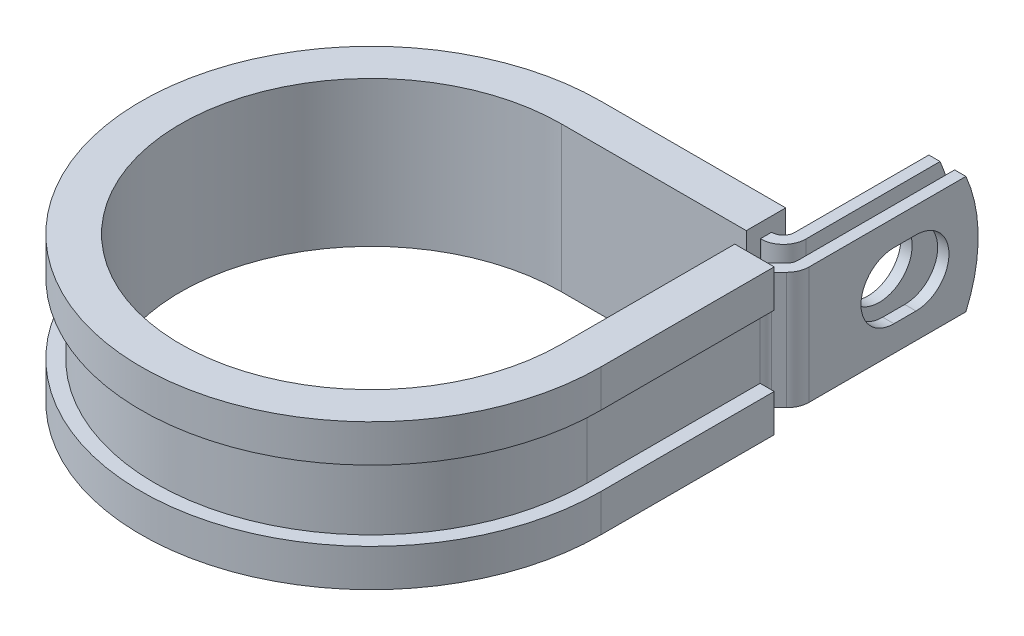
ISO-10303-21;
HEADER;
FILE_DESCRIPTION(('STEP AP214'),'2;1');
FILE_NAME('part.step','',(''),(''),'','','');
FILE_SCHEMA(('AUTOMOTIVE_DESIGN { 1 0 10303 214 1 1 1 1 }'));
ENDSEC;
DATA;
#1=APPLICATION_CONTEXT('core data for automotive mechanical design processes');
#2=APPLICATION_PROTOCOL_DEFINITION('international standard','automotive_design',2000,#1);
#3=PRODUCT_CONTEXT('',#1,'mechanical');
#4=PRODUCT('Part','Part','',(#3));
#5=PRODUCT_RELATED_PRODUCT_CATEGORY('part','',(#4));
#6=PRODUCT_DEFINITION_FORMATION('','',#4);
#7=PRODUCT_DEFINITION_CONTEXT('part definition',#1,'design');
#8=PRODUCT_DEFINITION('design','',#6,#7);
#9=PRODUCT_DEFINITION_SHAPE('','',#8);
#10=(LENGTH_UNIT() NAMED_UNIT(*) SI_UNIT(.MILLI.,.METRE.));
#11=(NAMED_UNIT(*) PLANE_ANGLE_UNIT() SI_UNIT($,.RADIAN.));
#12=(NAMED_UNIT(*) SI_UNIT($,.STERADIAN.) SOLID_ANGLE_UNIT());
#13=UNCERTAINTY_MEASURE_WITH_UNIT(LENGTH_MEASURE(1.E-05),#10,'distance_accuracy_value','');
#14=(GEOMETRIC_REPRESENTATION_CONTEXT(3) GLOBAL_UNCERTAINTY_ASSIGNED_CONTEXT((#13)) GLOBAL_UNIT_ASSIGNED_CONTEXT((#10,
#11,#12)) REPRESENTATION_CONTEXT('',''));
#15=CARTESIAN_POINT('',(0.,0.,0.));
#16=DIRECTION('',(0.,0.,1.));
#17=DIRECTION('',(1.,0.,0.));
#18=AXIS2_PLACEMENT_3D('',#15,#16,#17);
#19=CARTESIAN_POINT('',(22.8397698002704,-6.35,-22.1615));
#20=DIRECTION('',(0.,1.,0.));
#21=DIRECTION('',(1.,0.,0.));
#22=AXIS2_PLACEMENT_3D('',#19,#20,#21);
#23=PLANE('',#22);
#24=DIRECTION('',(0.,0.,-1.));
#25=VECTOR('',#24,1.);
#26=CARTESIAN_POINT('',(19.9949698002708,-6.35,-22.1615));
#27=LINE('',#26,#25);
#28=CARTESIAN_POINT('',(19.9949698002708,-6.35,-22.1615));
#29=VERTEX_POINT('',#28);
#30=CARTESIAN_POINT('',(19.9949698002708,-6.35,-23.3807));
#31=VERTEX_POINT('',#30);
#32=EDGE_CURVE('E523',#29,#31,#27,.T.);
#33=ORIENTED_EDGE('',*,*,#32,.T.);
#34=DIRECTION('',(1.,0.,0.));
#35=VECTOR('',#34,1.);
#36=CARTESIAN_POINT('',(0.,-6.35,-23.3807));
#37=LINE('',#36,#35);
#38=CARTESIAN_POINT('',(20.0457698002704,-6.35,-23.3807));
#39=VERTEX_POINT('',#38);
#40=EDGE_CURVE('E410',#39,#31,#37,.F.);
#41=ORIENTED_EDGE('',*,*,#40,.F.);
#42=CARTESIAN_POINT('',(20.0457698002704,-6.35,-24.5999));
#43=DIRECTION('',(0.,1.,0.));
#44=DIRECTION('',(1.,0.,0.));
#45=AXIS2_PLACEMENT_3D('',#42,#43,#44);
#46=CIRCLE('',#45,1.2192);
#47=CARTESIAN_POINT('',(21.2649698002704,-6.35,-24.5999));
#48=VERTEX_POINT('',#47);
#49=EDGE_CURVE('E408',#48,#39,#46,.F.);
#50=ORIENTED_EDGE('',*,*,#49,.F.);
#51=DIRECTION('',(0.,0.,1.));
#52=VECTOR('',#51,1.);
#53=CARTESIAN_POINT('',(21.2649698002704,-6.35,-40.4622));
#54=LINE('',#53,#52);
#55=CARTESIAN_POINT('',(21.2649698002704,-6.35,-39.1368778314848));
#56=VERTEX_POINT('',#55);
#57=EDGE_CURVE('E406',#56,#48,#54,.T.);
#58=ORIENTED_EDGE('',*,*,#57,.F.);
#59=DIRECTION('',(-1.,0.,0.));
#60=VECTOR('',#59,1.);
#61=CARTESIAN_POINT('',(25.2781698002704,-6.35,-39.1368778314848));
#62=LINE('',#61,#60);
#63=CARTESIAN_POINT('',(22.4841698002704,-6.35,-39.1368778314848));
#64=VERTEX_POINT('',#63);
#65=EDGE_CURVE('E12',#64,#56,#62,.T.);
#66=ORIENTED_EDGE('',*,*,#65,.F.);
#67=DIRECTION('',(0.,0.,1.));
#68=VECTOR('',#67,1.);
#69=CARTESIAN_POINT('',(22.4841698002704,-6.35,-40.4622));
#70=LINE('',#69,#68);
#71=CARTESIAN_POINT('',(22.4841698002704,-6.35,-24.5999));
#72=VERTEX_POINT('',#71);
#73=EDGE_CURVE('E404',#64,#72,#70,.T.);
#74=ORIENTED_EDGE('',*,*,#73,.T.);
#75=CARTESIAN_POINT('',(20.0457698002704,-6.35,-24.5999));
#76=DIRECTION('',(0.,-1.,0.));
#77=DIRECTION('',(0.,0.,1.));
#78=AXIS2_PLACEMENT_3D('',#75,#76,#77);
#79=CIRCLE('',#78,2.4384);
#80=CARTESIAN_POINT('',(20.0457698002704,-6.35,-22.1615));
#81=VERTEX_POINT('',#80);
#82=EDGE_CURVE('E401',#72,#81,#79,.T.);
#83=ORIENTED_EDGE('',*,*,#82,.T.);
#84=DIRECTION('',(-1.,0.,0.));
#85=VECTOR('',#84,1.);
#86=CARTESIAN_POINT('',(0.,-6.35,-22.1615));
#87=LINE('',#86,#85);
#88=EDGE_CURVE('E398',#81,#29,#87,.T.);
#89=ORIENTED_EDGE('',*,*,#88,.T.);
#90=EDGE_LOOP('',(#33,#41,#50,#58,#66,#74,#83,#89));
#91=FACE_BOUND('',#90,.T.);
#92=ADVANCED_FACE('F54',(#91),#23,.F.);
#93=CARTESIAN_POINT('',(22.8397698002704,6.35,-22.1615));
#94=DIRECTION('',(0.,1.,0.));
#95=DIRECTION('',(1.,0.,0.));
#96=AXIS2_PLACEMENT_3D('',#93,#94,#95);
#97=PLANE('',#96);
#98=DIRECTION('',(1.,0.,0.));
#99=VECTOR('',#98,1.);
#100=CARTESIAN_POINT('',(0.,6.35,-23.3807));
#101=LINE('',#100,#99);
#102=CARTESIAN_POINT('',(20.0457698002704,6.35,-23.3807));
#103=VERTEX_POINT('',#102);
#104=CARTESIAN_POINT('',(19.9949698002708,6.35,-23.3807));
#105=VERTEX_POINT('',#104);
#106=EDGE_CURVE('E368',#103,#105,#101,.F.);
#107=ORIENTED_EDGE('',*,*,#106,.T.);
#108=DIRECTION('',(0.,0.,1.));
#109=VECTOR('',#108,1.);
#110=CARTESIAN_POINT('',(19.9949698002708,6.35,-23.3807));
#111=LINE('',#110,#109);
#112=CARTESIAN_POINT('',(19.9949698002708,6.35,-22.1615));
#113=VERTEX_POINT('',#112);
#114=EDGE_CURVE('E517',#105,#113,#111,.T.);
#115=ORIENTED_EDGE('',*,*,#114,.T.);
#116=DIRECTION('',(-1.,0.,0.));
#117=VECTOR('',#116,1.);
#118=CARTESIAN_POINT('',(0.,6.35,-22.1615));
#119=LINE('',#118,#117);
#120=CARTESIAN_POINT('',(20.0457698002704,6.35,-22.1615));
#121=VERTEX_POINT('',#120);
#122=EDGE_CURVE('E625',#121,#113,#119,.T.);
#123=ORIENTED_EDGE('',*,*,#122,.F.);
#124=CARTESIAN_POINT('',(20.0457698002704,6.35,-24.5999));
#125=DIRECTION('',(0.,-1.,0.));
#126=DIRECTION('',(0.,0.,1.));
#127=AXIS2_PLACEMENT_3D('',#124,#125,#126);
#128=CIRCLE('',#127,2.4384);
#129=CARTESIAN_POINT('',(22.4841698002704,6.35,-24.5999));
#130=VERTEX_POINT('',#129);
#131=EDGE_CURVE('E370',#130,#121,#128,.T.);
#132=ORIENTED_EDGE('',*,*,#131,.F.);
#133=DIRECTION('',(0.,0.,1.));
#134=VECTOR('',#133,1.);
#135=CARTESIAN_POINT('',(22.4841698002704,6.35,-40.4622));
#136=LINE('',#135,#134);
#137=CARTESIAN_POINT('',(22.4841698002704,6.35,-39.1368778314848));
#138=VERTEX_POINT('',#137);
#139=EDGE_CURVE('E361',#138,#130,#136,.T.);
#140=ORIENTED_EDGE('',*,*,#139,.F.);
#141=DIRECTION('',(-1.,0.,0.));
#142=VECTOR('',#141,1.);
#143=CARTESIAN_POINT('',(25.2781698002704,6.35,-39.1368778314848));
#144=LINE('',#143,#142);
#145=CARTESIAN_POINT('',(21.2649698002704,6.35,-39.1368778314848));
#146=VERTEX_POINT('',#145);
#147=EDGE_CURVE('E62',#138,#146,#144,.T.);
#148=ORIENTED_EDGE('',*,*,#147,.T.);
#149=DIRECTION('',(0.,0.,1.));
#150=VECTOR('',#149,1.);
#151=CARTESIAN_POINT('',(21.2649698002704,6.35,-40.4622));
#152=LINE('',#151,#150);
#153=CARTESIAN_POINT('',(21.2649698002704,6.35,-24.5999));
#154=VERTEX_POINT('',#153);
#155=EDGE_CURVE('E358',#146,#154,#152,.T.);
#156=ORIENTED_EDGE('',*,*,#155,.T.);
#157=CARTESIAN_POINT('',(20.0457698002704,6.35,-24.5999));
#158=DIRECTION('',(0.,1.,0.));
#159=DIRECTION('',(1.,0.,0.));
#160=AXIS2_PLACEMENT_3D('',#157,#158,#159);
#161=CIRCLE('',#160,1.2192);
#162=EDGE_CURVE('E366',#154,#103,#161,.F.);
#163=ORIENTED_EDGE('',*,*,#162,.T.);
#164=EDGE_LOOP('',(#107,#115,#123,#132,#140,#148,#156,#163));
#165=FACE_BOUND('',#164,.T.);
#166=ADVANCED_FACE('F357',(#165),#97,.T.);
#167=CARTESIAN_POINT('',(0.,6.35,-22.1615));
#168=DIRECTION('',(0.,0.,1.));
#169=DIRECTION('',(1.,0.,0.));
#170=AXIS2_PLACEMENT_3D('',#167,#168,#169);
#171=PLANE('',#170);
#172=ORIENTED_EDGE('',*,*,#122,.T.);
#173=DIRECTION('',(0.,-1.,0.));
#174=VECTOR('',#173,1.);
#175=CARTESIAN_POINT('',(19.9949698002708,6.35,-22.1615));
#176=LINE('',#175,#174);
#177=EDGE_CURVE('E520',#113,#29,#176,.T.);
#178=ORIENTED_EDGE('',*,*,#177,.T.);
#179=ORIENTED_EDGE('',*,*,#88,.F.);
#180=DIRECTION('',(0.,-1.,0.));
#181=VECTOR('',#180,1.);
#182=CARTESIAN_POINT('',(20.0457698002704,6.35,-22.1615));
#183=LINE('',#182,#181);
#184=EDGE_CURVE('E344',#121,#81,#183,.T.);
#185=ORIENTED_EDGE('',*,*,#184,.F.);
#186=EDGE_LOOP('',(#172,#178,#179,#185));
#187=FACE_BOUND('',#186,.T.);
#188=ADVANCED_FACE('F635',(#187),#171,.T.);
#189=CARTESIAN_POINT('',(25.2781698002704,6.35,-22.1615));
#190=DIRECTION('',(-1.,0.,0.));
#191=DIRECTION('',(0.,0.,1.));
#192=AXIS2_PLACEMENT_3D('',#189,#190,#191);
#193=PLANE('',#192);
#194=CARTESIAN_POINT('',(25.2781698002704,0.,-33.7311999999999));
#195=DIRECTION('',(1.,0.,0.));
#196=DIRECTION('',(0.,0.,-1.));
#197=AXIS2_PLACEMENT_3D('',#194,#195,#196);
#198=CIRCLE('',#197,3.5687);
#199=CARTESIAN_POINT('',(25.2781698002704,-3.5687,-33.7312000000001));
#200=VERTEX_POINT('',#199);
#201=CARTESIAN_POINT('',(25.2781698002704,3.5687,-33.7312000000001));
#202=VERTEX_POINT('',#201);
#203=EDGE_CURVE('E580',#200,#202,#198,.T.);
#204=ORIENTED_EDGE('',*,*,#203,.F.);
#205=DIRECTION('',(0.,0.,-1.));
#206=VECTOR('',#205,1.);
#207=CARTESIAN_POINT('',(25.2781698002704,-3.5687,-31.3435999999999));
#208=LINE('',#207,#206);
#209=CARTESIAN_POINT('',(25.2781698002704,-3.5687,-31.3435999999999));
#210=VERTEX_POINT('',#209);
#211=EDGE_CURVE('E583',#210,#200,#208,.T.);
#212=ORIENTED_EDGE('',*,*,#211,.F.);
#213=CARTESIAN_POINT('',(25.2781698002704,0.,-31.3435999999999));
#214=DIRECTION('',(1.,0.,0.));
#215=DIRECTION('',(0.,0.,-1.));
#216=AXIS2_PLACEMENT_3D('',#213,#214,#215);
#217=CIRCLE('',#216,3.5687);
#218=CARTESIAN_POINT('',(25.2781698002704,3.5687,-31.3435999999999));
#219=VERTEX_POINT('',#218);
#220=EDGE_CURVE('E576',#219,#210,#217,.T.);
#221=ORIENTED_EDGE('',*,*,#220,.F.);
#222=DIRECTION('',(0.,0.,1.));
#223=VECTOR('',#222,1.);
#224=CARTESIAN_POINT('',(25.2781698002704,3.5687,-31.3435999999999));
#225=LINE('',#224,#223);
#226=EDGE_CURVE('E577',#202,#219,#225,.T.);
#227=ORIENTED_EDGE('',*,*,#226,.F.);
#228=EDGE_LOOP('',(#204,#212,#221,#227));
#229=FACE_BOUND('',#228,.T.);
#230=DIRECTION('',(0.,0.,-1.));
#231=VECTOR('',#230,1.);
#232=CARTESIAN_POINT('',(25.2781698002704,-6.35,-22.1615));
#233=LINE('',#232,#231);
#234=CARTESIAN_POINT('',(25.2781698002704,-6.35,-22.1615));
#235=VERTEX_POINT('',#234);
#236=CARTESIAN_POINT('',(25.2781698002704,-6.35,-39.1368778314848));
#237=VERTEX_POINT('',#236);
#238=EDGE_CURVE('E382',#235,#237,#233,.T.);
#239=ORIENTED_EDGE('',*,*,#238,.T.);
#240=CARTESIAN_POINT('',(25.2781698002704,0.,-24.5872));
#241=DIRECTION('',(-1.,0.,0.));
#242=DIRECTION('',(0.,0.,1.));
#243=AXIS2_PLACEMENT_3D('',#240,#241,#242);
#244=CIRCLE('',#243,15.875);
#245=CARTESIAN_POINT('',(25.2781698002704,6.35,-39.1368778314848));
#246=VERTEX_POINT('',#245);
#247=EDGE_CURVE('E568',#246,#237,#244,.T.);
#248=ORIENTED_EDGE('',*,*,#247,.F.);
#249=DIRECTION('',(0.,0.,-1.));
#250=VECTOR('',#249,1.);
#251=CARTESIAN_POINT('',(25.2781698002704,6.35,-22.1615));
#252=LINE('',#251,#250);
#253=CARTESIAN_POINT('',(25.2781698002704,6.35,-22.1615));
#254=VERTEX_POINT('',#253);
#255=EDGE_CURVE('E419',#254,#246,#252,.T.);
#256=ORIENTED_EDGE('',*,*,#255,.F.);
#257=DIRECTION('',(0.,-1.,0.));
#258=VECTOR('',#257,1.);
#259=CARTESIAN_POINT('',(25.2781698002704,6.35,-22.1615));
#260=LINE('',#259,#258);
#261=EDGE_CURVE('E381',#254,#235,#260,.T.);
#262=ORIENTED_EDGE('',*,*,#261,.T.);
#263=EDGE_LOOP('',(#239,#248,#256,#262));
#264=FACE_BOUND('',#263,.T.);
#265=ADVANCED_FACE('F56',(#229,#264),#193,.F.);
#266=CARTESIAN_POINT('',(24.0589698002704,6.35,-22.1615));
#267=DIRECTION('',(-1.,0.,0.));
#268=DIRECTION('',(0.,0.,1.));
#269=AXIS2_PLACEMENT_3D('',#266,#267,#268);
#270=PLANE('',#269);
#271=DIRECTION('',(0.,0.,-1.));
#272=VECTOR('',#271,1.);
#273=CARTESIAN_POINT('',(24.0589698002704,-3.5687,-31.3435999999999));
#274=LINE('',#273,#272);
#275=CARTESIAN_POINT('',(24.0589698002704,-3.5687,-31.3435999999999));
#276=VERTEX_POINT('',#275);
#277=CARTESIAN_POINT('',(24.0589698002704,-3.5687,-33.7312000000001));
#278=VERTEX_POINT('',#277);
#279=EDGE_CURVE('E579',#276,#278,#274,.T.);
#280=ORIENTED_EDGE('',*,*,#279,.T.);
#281=CARTESIAN_POINT('',(24.0589698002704,0.,-33.7311999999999));
#282=DIRECTION('',(-1.,0.,0.));
#283=DIRECTION('',(0.,0.,1.));
#284=AXIS2_PLACEMENT_3D('',#281,#282,#283);
#285=CIRCLE('',#284,3.5687);
#286=CARTESIAN_POINT('',(24.0589698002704,3.5687,-33.7312000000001));
#287=VERTEX_POINT('',#286);
#288=EDGE_CURVE('E600',#278,#287,#285,.F.);
#289=ORIENTED_EDGE('',*,*,#288,.T.);
#290=DIRECTION('',(0.,0.,1.));
#291=VECTOR('',#290,1.);
#292=CARTESIAN_POINT('',(24.0589698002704,3.5687,-31.3435999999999));
#293=LINE('',#292,#291);
#294=CARTESIAN_POINT('',(24.0589698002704,3.5687,-31.3435999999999));
#295=VERTEX_POINT('',#294);
#296=EDGE_CURVE('E596',#287,#295,#293,.T.);
#297=ORIENTED_EDGE('',*,*,#296,.T.);
#298=CARTESIAN_POINT('',(24.0589698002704,0.,-31.3435999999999));
#299=DIRECTION('',(-1.,0.,0.));
#300=DIRECTION('',(0.,0.,1.));
#301=AXIS2_PLACEMENT_3D('',#298,#299,#300);
#302=CIRCLE('',#301,3.5687);
#303=EDGE_CURVE('E591',#295,#276,#302,.F.);
#304=ORIENTED_EDGE('',*,*,#303,.T.);
#305=EDGE_LOOP('',(#280,#289,#297,#304));
#306=FACE_BOUND('',#305,.T.);
#307=CARTESIAN_POINT('',(24.0589698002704,0.,-24.5872));
#308=DIRECTION('',(-1.,0.,0.));
#309=DIRECTION('',(0.,0.,1.));
#310=AXIS2_PLACEMENT_3D('',#307,#308,#309);
#311=CIRCLE('',#310,15.875);
#312=CARTESIAN_POINT('',(24.0589698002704,6.35,-39.1368778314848));
#313=VERTEX_POINT('',#312);
#314=CARTESIAN_POINT('',(24.0589698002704,-6.35,-39.1368778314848));
#315=VERTEX_POINT('',#314);
#316=EDGE_CURVE('E76',#313,#315,#311,.T.);
#317=ORIENTED_EDGE('',*,*,#316,.T.);
#318=DIRECTION('',(0.,0.,-1.));
#319=VECTOR('',#318,1.);
#320=CARTESIAN_POINT('',(24.0589698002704,-6.35,-22.1615));
#321=LINE('',#320,#319);
#322=CARTESIAN_POINT('',(24.0589698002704,-6.35,-22.1615));
#323=VERTEX_POINT('',#322);
#324=EDGE_CURVE('E385',#323,#315,#321,.T.);
#325=ORIENTED_EDGE('',*,*,#324,.F.);
#326=DIRECTION('',(0.,-1.,0.));
#327=VECTOR('',#326,1.);
#328=CARTESIAN_POINT('',(24.0589698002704,6.35,-22.1615));
#329=LINE('',#328,#327);
#330=CARTESIAN_POINT('',(24.0589698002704,6.35,-22.1615));
#331=VERTEX_POINT('',#330);
#332=EDGE_CURVE('E352',#331,#323,#329,.T.);
#333=ORIENTED_EDGE('',*,*,#332,.F.);
#334=DIRECTION('',(0.,0.,-1.));
#335=VECTOR('',#334,1.);
#336=CARTESIAN_POINT('',(24.0589698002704,6.35,-22.1615));
#337=LINE('',#336,#335);
#338=EDGE_CURVE('E615',#331,#313,#337,.T.);
#339=ORIENTED_EDGE('',*,*,#338,.T.);
#340=EDGE_LOOP('',(#317,#325,#333,#339));
#341=FACE_BOUND('',#340,.T.);
#342=ADVANCED_FACE('F689',(#306,#341),#270,.T.);
#343=CARTESIAN_POINT('',(22.4841698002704,6.35,-40.4622));
#344=DIRECTION('',(1.,0.,0.));
#345=DIRECTION('',(0.,0.,-1.));
#346=AXIS2_PLACEMENT_3D('',#343,#344,#345);
#347=PLANE('',#346);
#348=CARTESIAN_POINT('',(22.4841698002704,0.,-32.5374));
#349=DIRECTION('',(1.,0.,0.));
#350=DIRECTION('',(0.,0.,-1.));
#351=AXIS2_PLACEMENT_3D('',#348,#349,#350);
#352=CIRCLE('',#351,3.5687);
#353=CARTESIAN_POINT('',(22.4841698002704,0.,-36.1061));
#354=VERTEX_POINT('',#353);
#355=EDGE_CURVE('E386',#354,#354,#352,.F.);
#356=ORIENTED_EDGE('',*,*,#355,.T.);
#357=EDGE_LOOP('',(#356));
#358=FACE_BOUND('',#357,.T.);
#359=ORIENTED_EDGE('',*,*,#73,.F.);
#360=CARTESIAN_POINT('',(22.4841698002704,0.,-24.5872));
#361=DIRECTION('',(1.,0.,0.));
#362=DIRECTION('',(0.,0.,-1.));
#363=AXIS2_PLACEMENT_3D('',#360,#361,#362);
#364=CIRCLE('',#363,15.875);
#365=EDGE_CURVE('E573',#64,#138,#364,.T.);
#366=ORIENTED_EDGE('',*,*,#365,.T.);
#367=ORIENTED_EDGE('',*,*,#139,.T.);
#368=DIRECTION('',(0.,-1.,0.));
#369=VECTOR('',#368,1.);
#370=CARTESIAN_POINT('',(22.4841698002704,6.35,-24.5999));
#371=LINE('',#370,#369);
#372=EDGE_CURVE('E341',#130,#72,#371,.T.);
#373=ORIENTED_EDGE('',*,*,#372,.T.);
#374=EDGE_LOOP('',(#359,#366,#367,#373));
#375=FACE_BOUND('',#374,.T.);
#376=ADVANCED_FACE('F641',(#358,#375),#347,.T.);
#377=CARTESIAN_POINT('',(21.2649698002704,6.35,-40.4622));
#378=DIRECTION('',(1.,0.,0.));
#379=DIRECTION('',(0.,0.,-1.));
#380=AXIS2_PLACEMENT_3D('',#377,#378,#379);
#381=PLANE('',#380);
#382=CARTESIAN_POINT('',(21.2649698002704,0.,-32.5374));
#383=DIRECTION('',(-1.,0.,0.));
#384=DIRECTION('',(0.,0.,1.));
#385=AXIS2_PLACEMENT_3D('',#382,#383,#384);
#386=CIRCLE('',#385,3.5687);
#387=CARTESIAN_POINT('',(21.2649698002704,0.,-28.9687));
#388=VERTEX_POINT('',#387);
#389=EDGE_CURVE('E608',#388,#388,#386,.T.);
#390=ORIENTED_EDGE('',*,*,#389,.F.);
#391=EDGE_LOOP('',(#390));
#392=FACE_BOUND('',#391,.T.);
#393=CARTESIAN_POINT('',(21.2649698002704,0.,-24.5872));
#394=DIRECTION('',(-1.,0.,0.));
#395=DIRECTION('',(0.,0.,1.));
#396=AXIS2_PLACEMENT_3D('',#393,#394,#395);
#397=CIRCLE('',#396,15.875);
#398=EDGE_CURVE('E68',#146,#56,#397,.T.);
#399=ORIENTED_EDGE('',*,*,#398,.T.);
#400=ORIENTED_EDGE('',*,*,#57,.T.);
#401=DIRECTION('',(0.,-1.,0.));
#402=VECTOR('',#401,1.);
#403=CARTESIAN_POINT('',(21.2649698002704,6.35,-24.5999));
#404=LINE('',#403,#402);
#405=EDGE_CURVE('E338',#154,#48,#404,.T.);
#406=ORIENTED_EDGE('',*,*,#405,.F.);
#407=ORIENTED_EDGE('',*,*,#155,.F.);
#408=EDGE_LOOP('',(#399,#400,#406,#407));
#409=FACE_BOUND('',#408,.T.);
#410=ADVANCED_FACE('F364',(#392,#409),#381,.F.);
#411=CARTESIAN_POINT('',(24.5999,-6.35,-18.7490026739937));
#412=DIRECTION('',(0.,1.,0.));
#413=DIRECTION('',(1.,0.,0.));
#414=AXIS2_PLACEMENT_3D('',#411,#412,#413);
#415=CIRCLE('',#414,1.2192);
#416=CARTESIAN_POINT('',(23.3807,-6.35,-18.7490026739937));
#417=VERTEX_POINT('',#416);
#418=CARTESIAN_POINT('',(23.7377954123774,-6.35,-19.6111072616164));
#419=VERTEX_POINT('',#418);
#420=EDGE_CURVE('E413',#417,#419,#415,.F.);
#421=ORIENTED_EDGE('',*,*,#420,.F.);
#422=DIRECTION('',(1.,0.,0.));
#423=VECTOR('',#422,1.);
#424=CARTESIAN_POINT('',(22.1615,-6.35,-18.7490026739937));
#425=LINE('',#424,#423);
#426=CARTESIAN_POINT('',(22.1615,-6.35,-18.7490026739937));
#427=VERTEX_POINT('',#426);
#428=EDGE_CURVE('E451',#427,#417,#425,.T.);
#429=ORIENTED_EDGE('',*,*,#428,.F.);
#430=CARTESIAN_POINT('',(24.5999,-6.35,-18.7490026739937));
#431=DIRECTION('',(0.,-1.,0.));
#432=DIRECTION('',(0.,0.,1.));
#433=AXIS2_PLACEMENT_3D('',#430,#431,#432);
#434=CIRCLE('',#433,2.4384);
#435=CARTESIAN_POINT('',(22.8756908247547,-6.35,-20.473211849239));
#436=VERTEX_POINT('',#435);
#437=EDGE_CURVE('E395',#427,#436,#434,.T.);
#438=ORIENTED_EDGE('',*,*,#437,.T.);
#439=DIRECTION('',(0.707106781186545,0.,-0.70710678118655));
#440=VECTOR('',#439,1.);
#441=CARTESIAN_POINT('',(22.8756908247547,-6.35,-20.473211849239));
#442=LINE('',#441,#440);
#443=CARTESIAN_POINT('',(23.7018743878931,-6.35,-21.2993954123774));
#444=VERTEX_POINT('',#443);
#445=EDGE_CURVE('E392',#436,#444,#442,.T.);
#446=ORIENTED_EDGE('',*,*,#445,.T.);
#447=CARTESIAN_POINT('',(22.8397698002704,-6.35,-22.1615));
#448=DIRECTION('',(0.,1.,0.));
#449=DIRECTION('',(0.,0.,1.));
#450=AXIS2_PLACEMENT_3D('',#447,#448,#449);
#451=CIRCLE('',#450,1.2192);
#452=EDGE_CURVE('E389',#444,#323,#451,.T.);
#453=ORIENTED_EDGE('',*,*,#452,.T.);
#454=ORIENTED_EDGE('',*,*,#324,.T.);
#455=DIRECTION('',(-1.,0.,0.));
#456=VECTOR('',#455,1.);
#457=CARTESIAN_POINT('',(25.2781698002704,-6.35,-39.1368778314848));
#458=LINE('',#457,#456);
#459=EDGE_CURVE('E566',#237,#315,#458,.T.);
#460=ORIENTED_EDGE('',*,*,#459,.F.);
#461=ORIENTED_EDGE('',*,*,#238,.F.);
#462=CARTESIAN_POINT('',(22.8397698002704,-6.35,-22.1615));
#463=DIRECTION('',(0.,1.,0.));
#464=DIRECTION('',(1.,0.,0.));
#465=AXIS2_PLACEMENT_3D('',#462,#463,#464);
#466=CIRCLE('',#465,2.4384);
#467=CARTESIAN_POINT('',(24.5639789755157,-6.35,-20.4372908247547));
#468=VERTEX_POINT('',#467);
#469=EDGE_CURVE('E417',#468,#235,#466,.T.);
#470=ORIENTED_EDGE('',*,*,#469,.F.);
#471=DIRECTION('',(0.707106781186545,0.,-0.70710678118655));
#472=VECTOR('',#471,1.);
#473=CARTESIAN_POINT('',(23.7377954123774,-6.35,-19.6111072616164));
#474=LINE('',#473,#472);
#475=EDGE_CURVE('E415',#419,#468,#474,.T.);
#476=ORIENTED_EDGE('',*,*,#475,.F.);
#477=EDGE_LOOP('',(#421,#429,#438,#446,#453,#454,#460,#461,#470,#476));
#478=FACE_BOUND('',#477,.T.);
#479=ADVANCED_FACE('F675',(#478),#23,.F.);
#480=DIRECTION('',(-1.,0.,0.));
#481=VECTOR('',#480,1.);
#482=CARTESIAN_POINT('',(23.3807,6.35,-18.7490026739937));
#483=LINE('',#482,#481);
#484=CARTESIAN_POINT('',(23.3807,6.35,-18.7490026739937));
#485=VERTEX_POINT('',#484);
#486=CARTESIAN_POINT('',(22.1615,6.35,-18.7490026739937));
#487=VERTEX_POINT('',#486);
#488=EDGE_CURVE('E440',#485,#487,#483,.T.);
#489=ORIENTED_EDGE('',*,*,#488,.F.);
#490=CARTESIAN_POINT('',(24.5999,6.35,-18.7490026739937));
#491=DIRECTION('',(0.,1.,0.));
#492=DIRECTION('',(1.,0.,0.));
#493=AXIS2_PLACEMENT_3D('',#490,#491,#492);
#494=CIRCLE('',#493,1.2192);
#495=CARTESIAN_POINT('',(23.7377954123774,6.35,-19.6111072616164));
#496=VERTEX_POINT('',#495);
#497=EDGE_CURVE('E375',#485,#496,#494,.F.);
#498=ORIENTED_EDGE('',*,*,#497,.T.);
#499=DIRECTION('',(0.707106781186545,0.,-0.70710678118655));
#500=VECTOR('',#499,1.);
#501=CARTESIAN_POINT('',(23.7377954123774,6.35,-19.6111072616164));
#502=LINE('',#501,#500);
#503=CARTESIAN_POINT('',(24.5639789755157,6.35,-20.4372908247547));
#504=VERTEX_POINT('',#503);
#505=EDGE_CURVE('E377',#496,#504,#502,.T.);
#506=ORIENTED_EDGE('',*,*,#505,.T.);
#507=CARTESIAN_POINT('',(22.8397698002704,6.35,-22.1615));
#508=DIRECTION('',(0.,1.,0.));
#509=DIRECTION('',(1.,0.,0.));
#510=AXIS2_PLACEMENT_3D('',#507,#508,#509);
#511=CIRCLE('',#510,2.4384);
#512=EDGE_CURVE('E379',#504,#254,#511,.T.);
#513=ORIENTED_EDGE('',*,*,#512,.T.);
#514=ORIENTED_EDGE('',*,*,#255,.T.);
#515=DIRECTION('',(-1.,0.,0.));
#516=VECTOR('',#515,1.);
#517=CARTESIAN_POINT('',(25.2781698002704,6.35,-39.1368778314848));
#518=LINE('',#517,#516);
#519=EDGE_CURVE('E570',#246,#313,#518,.T.);
#520=ORIENTED_EDGE('',*,*,#519,.T.);
#521=ORIENTED_EDGE('',*,*,#338,.F.);
#522=CARTESIAN_POINT('',(22.8397698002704,6.35,-22.1615));
#523=DIRECTION('',(0.,1.,0.));
#524=DIRECTION('',(0.,0.,1.));
#525=AXIS2_PLACEMENT_3D('',#522,#523,#524);
#526=CIRCLE('',#525,1.2192);
#527=CARTESIAN_POINT('',(23.7018743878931,6.35,-21.2993954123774));
#528=VERTEX_POINT('',#527);
#529=EDGE_CURVE('E618',#528,#331,#526,.T.);
#530=ORIENTED_EDGE('',*,*,#529,.F.);
#531=DIRECTION('',(0.707106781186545,0.,-0.70710678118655));
#532=VECTOR('',#531,1.);
#533=CARTESIAN_POINT('',(22.8756908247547,6.35,-20.473211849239));
#534=LINE('',#533,#532);
#535=CARTESIAN_POINT('',(22.8756908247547,6.35,-20.473211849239));
#536=VERTEX_POINT('',#535);
#537=EDGE_CURVE('E621',#536,#528,#534,.T.);
#538=ORIENTED_EDGE('',*,*,#537,.F.);
#539=CARTESIAN_POINT('',(24.5999,6.35,-18.7490026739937));
#540=DIRECTION('',(0.,-1.,0.));
#541=DIRECTION('',(0.,0.,1.));
#542=AXIS2_PLACEMENT_3D('',#539,#540,#541);
#543=CIRCLE('',#542,2.4384);
#544=EDGE_CURVE('E450',#487,#536,#543,.T.);
#545=ORIENTED_EDGE('',*,*,#544,.F.);
#546=EDGE_LOOP('',(#489,#498,#506,#513,#514,#520,#521,#530,#538,#545));
#547=FACE_BOUND('',#546,.T.);
#548=ADVANCED_FACE('F447',(#547),#97,.T.);
#549=CARTESIAN_POINT('',(22.8397698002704,6.35,-22.1615));
#550=DIRECTION('',(0.,-1.,0.));
#551=DIRECTION('',(0.,0.,-1.));
#552=AXIS2_PLACEMENT_3D('',#549,#550,#551);
#553=CYLINDRICAL_SURFACE('',#552,1.2192);
#554=ORIENTED_EDGE('',*,*,#452,.F.);
#555=DIRECTION('',(0.,-1.,0.));
#556=VECTOR('',#555,1.);
#557=CARTESIAN_POINT('',(23.7018743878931,6.35,-21.2993954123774));
#558=LINE('',#557,#556);
#559=EDGE_CURVE('E350',#528,#444,#558,.T.);
#560=ORIENTED_EDGE('',*,*,#559,.F.);
#561=ORIENTED_EDGE('',*,*,#529,.T.);
#562=ORIENTED_EDGE('',*,*,#332,.T.);
#563=EDGE_LOOP('',(#554,#560,#561,#562));
#564=FACE_BOUND('',#563,.T.);
#565=ADVANCED_FACE('F685',(#564),#553,.F.);
#566=CARTESIAN_POINT('',(22.8756908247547,6.35,-20.473211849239));
#567=DIRECTION('',(-0.70710678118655,0.,-0.707106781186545));
#568=DIRECTION('',(-0.707106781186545,0.,0.70710678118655));
#569=AXIS2_PLACEMENT_3D('',#566,#567,#568);
#570=PLANE('',#569);
#571=ORIENTED_EDGE('',*,*,#445,.F.);
#572=DIRECTION('',(0.,-1.,0.));
#573=VECTOR('',#572,1.);
#574=CARTESIAN_POINT('',(22.8756908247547,6.35,-20.473211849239));
#575=LINE('',#574,#573);
#576=EDGE_CURVE('E348',#536,#436,#575,.T.);
#577=ORIENTED_EDGE('',*,*,#576,.F.);
#578=ORIENTED_EDGE('',*,*,#537,.T.);
#579=ORIENTED_EDGE('',*,*,#559,.T.);
#580=EDGE_LOOP('',(#571,#577,#578,#579));
#581=FACE_BOUND('',#580,.T.);
#582=ADVANCED_FACE('F680',(#581),#570,.T.);
#583=CARTESIAN_POINT('',(24.5999,6.35,-18.7490026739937));
#584=DIRECTION('',(0.,-1.,0.));
#585=DIRECTION('',(0.,0.,-1.));
#586=AXIS2_PLACEMENT_3D('',#583,#584,#585);
#587=CYLINDRICAL_SURFACE('',#586,2.4384);
#588=ORIENTED_EDGE('',*,*,#437,.F.);
#589=DIRECTION('',(0.,-1.,0.));
#590=VECTOR('',#589,1.);
#591=CARTESIAN_POINT('',(22.1615,6.35,-18.7490026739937));
#592=LINE('',#591,#590);
#593=EDGE_CURVE('E346',#487,#427,#592,.T.);
#594=ORIENTED_EDGE('',*,*,#593,.F.);
#595=ORIENTED_EDGE('',*,*,#544,.T.);
#596=ORIENTED_EDGE('',*,*,#576,.T.);
#597=EDGE_LOOP('',(#588,#594,#595,#596));
#598=FACE_BOUND('',#597,.T.);
#599=ADVANCED_FACE('F677',(#598),#587,.T.);
#600=CARTESIAN_POINT('',(20.0457698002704,6.35,-24.5999));
#601=DIRECTION('',(0.,-1.,0.));
#602=DIRECTION('',(0.,0.,-1.));
#603=AXIS2_PLACEMENT_3D('',#600,#601,#602);
#604=CYLINDRICAL_SURFACE('',#603,2.4384);
#605=ORIENTED_EDGE('',*,*,#82,.F.);
#606=ORIENTED_EDGE('',*,*,#372,.F.);
#607=ORIENTED_EDGE('',*,*,#131,.T.);
#608=ORIENTED_EDGE('',*,*,#184,.T.);
#609=EDGE_LOOP('',(#605,#606,#607,#608));
#610=FACE_BOUND('',#609,.T.);
#611=ADVANCED_FACE('F631',(#610),#604,.T.);
#612=CARTESIAN_POINT('',(20.0457698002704,6.35,-24.5999));
#613=DIRECTION('',(0.,-1.,0.));
#614=DIRECTION('',(0.,0.,-1.));
#615=AXIS2_PLACEMENT_3D('',#612,#613,#614);
#616=CYLINDRICAL_SURFACE('',#615,1.2192);
#617=ORIENTED_EDGE('',*,*,#49,.T.);
#618=DIRECTION('',(0.,-1.,0.));
#619=VECTOR('',#618,1.);
#620=CARTESIAN_POINT('',(20.0457698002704,6.35,-23.3807));
#621=LINE('',#620,#619);
#622=EDGE_CURVE('E329',#103,#39,#621,.T.);
#623=ORIENTED_EDGE('',*,*,#622,.F.);
#624=ORIENTED_EDGE('',*,*,#162,.F.);
#625=ORIENTED_EDGE('',*,*,#405,.T.);
#626=EDGE_LOOP('',(#617,#623,#624,#625));
#627=FACE_BOUND('',#626,.T.);
#628=ADVANCED_FACE('F646',(#627),#616,.F.);
#629=CARTESIAN_POINT('',(0.,6.35,-23.3807));
#630=DIRECTION('',(0.,0.,1.));
#631=DIRECTION('',(1.,0.,0.));
#632=AXIS2_PLACEMENT_3D('',#629,#630,#631);
#633=PLANE('',#632);
#634=DIRECTION('',(0.,-1.,0.));
#635=VECTOR('',#634,1.);
#636=CARTESIAN_POINT('',(0.,6.35,-23.3807));
#637=LINE('',#636,#635);
#638=CARTESIAN_POINT('',(3.279647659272E-13,3.81,-23.3807));
#639=VERTEX_POINT('',#638);
#640=CARTESIAN_POINT('',(3.279647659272E-13,-3.81,-23.3807));
#641=VERTEX_POINT('',#640);
#642=EDGE_CURVE('E320',#639,#641,#637,.T.);
#643=ORIENTED_EDGE('',*,*,#642,.F.);
#644=DIRECTION('',(1.,0.,0.));
#645=VECTOR('',#644,1.);
#646=CARTESIAN_POINT('',(3.279647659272E-13,3.81,-23.3807));
#647=LINE('',#646,#645);
#648=CARTESIAN_POINT('',(19.9949698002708,3.81,-23.3807));
#649=VERTEX_POINT('',#648);
#650=EDGE_CURVE('E563',#639,#649,#647,.T.);
#651=ORIENTED_EDGE('',*,*,#650,.T.);
#652=DIRECTION('',(0.,1.,0.));
#653=VECTOR('',#652,1.);
#654=CARTESIAN_POINT('',(19.9949698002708,6.35,-23.3807));
#655=LINE('',#654,#653);
#656=EDGE_CURVE('E514',#649,#105,#655,.T.);
#657=ORIENTED_EDGE('',*,*,#656,.T.);
#658=ORIENTED_EDGE('',*,*,#106,.F.);
#659=ORIENTED_EDGE('',*,*,#622,.T.);
#660=ORIENTED_EDGE('',*,*,#40,.T.);
#661=DIRECTION('',(0.,1.,0.));
#662=VECTOR('',#661,1.);
#663=CARTESIAN_POINT('',(19.9949698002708,-6.35,-23.3807));
#664=LINE('',#663,#662);
#665=CARTESIAN_POINT('',(19.9949698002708,-3.81,-23.3807));
#666=VERTEX_POINT('',#665);
#667=EDGE_CURVE('E526',#31,#666,#664,.T.);
#668=ORIENTED_EDGE('',*,*,#667,.T.);
#669=DIRECTION('',(1.,0.,0.));
#670=VECTOR('',#669,1.);
#671=CARTESIAN_POINT('',(3.279647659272E-13,-3.81,-23.3807));
#672=LINE('',#671,#670);
#673=EDGE_CURVE('E543',#641,#666,#672,.T.);
#674=ORIENTED_EDGE('',*,*,#673,.F.);
#675=EDGE_LOOP('',(#643,#651,#657,#658,#659,#660,#668,#674));
#676=FACE_BOUND('',#675,.T.);
#677=ADVANCED_FACE('F650',(#676),#633,.F.);
#678=CARTESIAN_POINT('',(0.,6.35,0.));
#679=DIRECTION('',(0.,-1.,0.));
#680=DIRECTION('',(0.,0.,-1.));
#681=AXIS2_PLACEMENT_3D('',#678,#679,#680);
#682=CYLINDRICAL_SURFACE('',#681,23.3807);
#683=DIRECTION('',(0.,-1.,0.));
#684=VECTOR('',#683,1.);
#685=CARTESIAN_POINT('',(23.3807,6.35,0.));
#686=LINE('',#685,#684);
#687=CARTESIAN_POINT('',(23.3807,3.81,0.));
#688=VERTEX_POINT('',#687);
#689=CARTESIAN_POINT('',(23.3807,-3.81,0.));
#690=VERTEX_POINT('',#689);
#691=EDGE_CURVE('E318',#688,#690,#686,.T.);
#692=ORIENTED_EDGE('',*,*,#691,.F.);
#693=CARTESIAN_POINT('',(0.,3.81,0.));
#694=DIRECTION('',(0.,-1.,0.));
#695=DIRECTION('',(0.,0.,-1.));
#696=AXIS2_PLACEMENT_3D('',#693,#694,#695);
#697=CIRCLE('',#696,23.3807);
#698=EDGE_CURVE('E512',#688,#639,#697,.T.);
#699=ORIENTED_EDGE('',*,*,#698,.T.);
#700=ORIENTED_EDGE('',*,*,#642,.T.);
#701=CARTESIAN_POINT('',(0.,-3.81,0.));
#702=DIRECTION('',(0.,-1.,0.));
#703=DIRECTION('',(0.,0.,-1.));
#704=AXIS2_PLACEMENT_3D('',#701,#702,#703);
#705=CIRCLE('',#704,23.3807);
#706=EDGE_CURVE('E301',#690,#641,#705,.T.);
#707=ORIENTED_EDGE('',*,*,#706,.F.);
#708=EDGE_LOOP('',(#692,#699,#700,#707));
#709=FACE_BOUND('',#708,.T.);
#710=ADVANCED_FACE('F316',(#709),#682,.T.);
#711=CARTESIAN_POINT('',(23.3807,6.35,0.));
#712=DIRECTION('',(-1.,0.,0.));
#713=DIRECTION('',(0.,0.,1.));
#714=AXIS2_PLACEMENT_3D('',#711,#712,#713);
#715=PLANE('',#714);
#716=DIRECTION('',(0.,-1.,0.));
#717=VECTOR('',#716,1.);
#718=CARTESIAN_POINT('',(23.3807,6.35,-18.7490026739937));
#719=LINE('',#718,#717);
#720=CARTESIAN_POINT('',(23.3807,3.81,-18.7490026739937));
#721=VERTEX_POINT('',#720);
#722=CARTESIAN_POINT('',(23.3807,-3.81,-18.7490026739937));
#723=VERTEX_POINT('',#722);
#724=EDGE_CURVE('E332',#721,#723,#719,.T.);
#725=ORIENTED_EDGE('',*,*,#724,.F.);
#726=DIRECTION('',(0.,0.,-1.));
#727=VECTOR('',#726,1.);
#728=CARTESIAN_POINT('',(23.3807,3.81,0.));
#729=LINE('',#728,#727);
#730=EDGE_CURVE('E326',#688,#721,#729,.T.);
#731=ORIENTED_EDGE('',*,*,#730,.F.);
#732=ORIENTED_EDGE('',*,*,#691,.T.);
#733=DIRECTION('',(0.,0.,-1.));
#734=VECTOR('',#733,1.);
#735=CARTESIAN_POINT('',(23.3807,-3.81,0.));
#736=LINE('',#735,#734);
#737=EDGE_CURVE('E297',#690,#723,#736,.T.);
#738=ORIENTED_EDGE('',*,*,#737,.T.);
#739=EDGE_LOOP('',(#725,#731,#732,#738));
#740=FACE_BOUND('',#739,.T.);
#741=ADVANCED_FACE('F325',(#740),#715,.F.);
#742=CARTESIAN_POINT('',(24.5999,6.35,-18.7490026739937));
#743=DIRECTION('',(0.,-1.,0.));
#744=DIRECTION('',(0.,0.,-1.));
#745=AXIS2_PLACEMENT_3D('',#742,#743,#744);
#746=CYLINDRICAL_SURFACE('',#745,1.2192);
#747=ORIENTED_EDGE('',*,*,#420,.T.);
#748=DIRECTION('',(0.,-1.,0.));
#749=VECTOR('',#748,1.);
#750=CARTESIAN_POINT('',(23.7377954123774,6.35,-19.6111072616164));
#751=LINE('',#750,#749);
#752=EDGE_CURVE('E424',#496,#419,#751,.T.);
#753=ORIENTED_EDGE('',*,*,#752,.F.);
#754=ORIENTED_EDGE('',*,*,#497,.F.);
#755=EDGE_CURVE('E327',#485,#721,#719,.T.);
#756=ORIENTED_EDGE('',*,*,#755,.T.);
#757=ORIENTED_EDGE('',*,*,#724,.T.);
#758=DIRECTION('',(0.,1.,0.));
#759=VECTOR('',#758,1.);
#760=CARTESIAN_POINT('',(23.3807,-6.35,-18.7490026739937));
#761=LINE('',#760,#759);
#762=EDGE_CURVE('E433',#417,#723,#761,.T.);
#763=ORIENTED_EDGE('',*,*,#762,.F.);
#764=EDGE_LOOP('',(#747,#753,#754,#756,#757,#763));
#765=FACE_BOUND('',#764,.T.);
#766=ADVANCED_FACE('F432',(#765),#746,.F.);
#767=CARTESIAN_POINT('',(23.7377954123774,6.35,-19.6111072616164));
#768=DIRECTION('',(-0.70710678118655,0.,-0.707106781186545));
#769=DIRECTION('',(-0.707106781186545,0.,0.70710678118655));
#770=AXIS2_PLACEMENT_3D('',#767,#768,#769);
#771=PLANE('',#770);
#772=ORIENTED_EDGE('',*,*,#475,.T.);
#773=DIRECTION('',(0.,-1.,0.));
#774=VECTOR('',#773,1.);
#775=CARTESIAN_POINT('',(24.5639789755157,6.35,-20.4372908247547));
#776=LINE('',#775,#774);
#777=EDGE_CURVE('E422',#504,#468,#776,.T.);
#778=ORIENTED_EDGE('',*,*,#777,.F.);
#779=ORIENTED_EDGE('',*,*,#505,.F.);
#780=ORIENTED_EDGE('',*,*,#752,.T.);
#781=EDGE_LOOP('',(#772,#778,#779,#780));
#782=FACE_BOUND('',#781,.T.);
#783=ADVANCED_FACE('F701',(#782),#771,.F.);
#784=CARTESIAN_POINT('',(22.8397698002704,6.35,-22.1615));
#785=DIRECTION('',(0.,-1.,0.));
#786=DIRECTION('',(0.,0.,-1.));
#787=AXIS2_PLACEMENT_3D('',#784,#785,#786);
#788=CYLINDRICAL_SURFACE('',#787,2.4384);
#789=ORIENTED_EDGE('',*,*,#469,.T.);
#790=ORIENTED_EDGE('',*,*,#261,.F.);
#791=ORIENTED_EDGE('',*,*,#512,.F.);
#792=ORIENTED_EDGE('',*,*,#777,.T.);
#793=EDGE_LOOP('',(#789,#790,#791,#792));
#794=FACE_BOUND('',#793,.T.);
#795=ADVANCED_FACE('F699',(#794),#788,.T.);
#796=CARTESIAN_POINT('',(32.5779776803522,0.,-32.5374));
#797=DIRECTION('',(-1.,0.,0.));
#798=DIRECTION('',(0.,0.,1.));
#799=AXIS2_PLACEMENT_3D('',#796,#797,#798);
#800=CYLINDRICAL_SURFACE('',#799,3.5687);
#801=ORIENTED_EDGE('',*,*,#389,.T.);
#802=EDGE_LOOP('',(#801));
#803=FACE_BOUND('',#802,.T.);
#804=ORIENTED_EDGE('',*,*,#355,.F.);
#805=EDGE_LOOP('',(#804));
#806=FACE_BOUND('',#805,.T.);
#807=ADVANCED_FACE('F708',(#803,#806),#800,.F.);
#808=CARTESIAN_POINT('',(12.1565287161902,-3.5687,-31.3435999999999));
#809=DIRECTION('',(0.,-1.,0.));
#810=DIRECTION('',(0.,0.,-1.));
#811=AXIS2_PLACEMENT_3D('',#808,#809,#810);
#812=PLANE('',#811);
#813=DIRECTION('',(1.,0.,0.));
#814=VECTOR('',#813,1.);
#815=CARTESIAN_POINT('',(12.1565287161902,-3.5687,-31.3435999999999));
#816=LINE('',#815,#814);
#817=EDGE_CURVE('E594',#276,#210,#816,.T.);
#818=ORIENTED_EDGE('',*,*,#817,.T.);
#819=ORIENTED_EDGE('',*,*,#211,.T.);
#820=DIRECTION('',(1.,0.,0.));
#821=VECTOR('',#820,1.);
#822=CARTESIAN_POINT('',(12.1565287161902,-3.5687,-33.7312000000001));
#823=LINE('',#822,#821);
#824=EDGE_CURVE('E590',#278,#200,#823,.T.);
#825=ORIENTED_EDGE('',*,*,#824,.F.);
#826=ORIENTED_EDGE('',*,*,#279,.F.);
#827=EDGE_LOOP('',(#818,#819,#825,#826));
#828=FACE_BOUND('',#827,.T.);
#829=ADVANCED_FACE('F751',(#828),#812,.F.);
#830=CARTESIAN_POINT('',(12.1565287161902,0.,-33.7311999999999));
#831=DIRECTION('',(1.,0.,0.));
#832=DIRECTION('',(0.,0.,-1.));
#833=AXIS2_PLACEMENT_3D('',#830,#831,#832);
#834=CYLINDRICAL_SURFACE('',#833,3.5687);
#835=ORIENTED_EDGE('',*,*,#824,.T.);
#836=ORIENTED_EDGE('',*,*,#203,.T.);
#837=DIRECTION('',(1.,0.,0.));
#838=VECTOR('',#837,1.);
#839=CARTESIAN_POINT('',(12.1565287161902,3.5687,-33.7312000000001));
#840=LINE('',#839,#838);
#841=EDGE_CURVE('E599',#287,#202,#840,.T.);
#842=ORIENTED_EDGE('',*,*,#841,.F.);
#843=ORIENTED_EDGE('',*,*,#288,.F.);
#844=EDGE_LOOP('',(#835,#836,#842,#843));
#845=FACE_BOUND('',#844,.T.);
#846=ADVANCED_FACE('F755',(#845),#834,.F.);
#847=CARTESIAN_POINT('',(12.1565287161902,3.5687,-31.3435999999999));
#848=DIRECTION('',(0.,1.,0.));
#849=DIRECTION('',(0.,0.,1.));
#850=AXIS2_PLACEMENT_3D('',#847,#848,#849);
#851=PLANE('',#850);
#852=ORIENTED_EDGE('',*,*,#841,.T.);
#853=ORIENTED_EDGE('',*,*,#226,.T.);
#854=DIRECTION('',(1.,0.,0.));
#855=VECTOR('',#854,1.);
#856=CARTESIAN_POINT('',(12.1565287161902,3.5687,-31.3435999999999));
#857=LINE('',#856,#855);
#858=EDGE_CURVE('E595',#295,#219,#857,.T.);
#859=ORIENTED_EDGE('',*,*,#858,.F.);
#860=ORIENTED_EDGE('',*,*,#296,.F.);
#861=EDGE_LOOP('',(#852,#853,#859,#860));
#862=FACE_BOUND('',#861,.T.);
#863=ADVANCED_FACE('F759',(#862),#851,.F.);
#864=CARTESIAN_POINT('',(12.1565287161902,0.,-31.3435999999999));
#865=DIRECTION('',(1.,0.,0.));
#866=DIRECTION('',(0.,0.,-1.));
#867=AXIS2_PLACEMENT_3D('',#864,#865,#866);
#868=CYLINDRICAL_SURFACE('',#867,3.5687);
#869=ORIENTED_EDGE('',*,*,#858,.T.);
#870=ORIENTED_EDGE('',*,*,#220,.T.);
#871=ORIENTED_EDGE('',*,*,#817,.F.);
#872=ORIENTED_EDGE('',*,*,#303,.F.);
#873=EDGE_LOOP('',(#869,#870,#871,#872));
#874=FACE_BOUND('',#873,.T.);
#875=ADVANCED_FACE('F763',(#874),#868,.F.);
#876=CARTESIAN_POINT('',(25.2781698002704,0.,-24.5872));
#877=DIRECTION('',(-1.,0.,0.));
#878=DIRECTION('',(0.,0.,1.));
#879=AXIS2_PLACEMENT_3D('',#876,#877,#878);
#880=CYLINDRICAL_SURFACE('',#879,15.875);
#881=ORIENTED_EDGE('',*,*,#365,.F.);
#882=ORIENTED_EDGE('',*,*,#65,.T.);
#883=ORIENTED_EDGE('',*,*,#398,.F.);
#884=ORIENTED_EDGE('',*,*,#147,.F.);
#885=EDGE_LOOP('',(#881,#882,#883,#884));
#886=FACE_BOUND('',#885,.T.);
#887=ADVANCED_FACE('F642',(#886),#880,.T.);
#888=ORIENTED_EDGE('',*,*,#519,.F.);
#889=ORIENTED_EDGE('',*,*,#247,.T.);
#890=ORIENTED_EDGE('',*,*,#459,.T.);
#891=ORIENTED_EDGE('',*,*,#316,.F.);
#892=EDGE_LOOP('',(#888,#889,#890,#891));
#893=FACE_BOUND('',#892,.T.);
#894=ADVANCED_FACE('F690',(#893),#880,.T.);
#895=CARTESIAN_POINT('',(3.49342154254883E-13,7.874,-24.9047));
#896=DIRECTION('',(0.,0.,1.));
#897=DIRECTION('',(1.,0.,0.));
#898=AXIS2_PLACEMENT_3D('',#895,#896,#897);
#899=PLANE('',#898);
#900=DIRECTION('',(0.,-1.,0.));
#901=VECTOR('',#900,1.);
#902=CARTESIAN_POINT('',(3.49342154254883E-13,7.874,-24.9047));
#903=LINE('',#902,#901);
#904=CARTESIAN_POINT('',(3.49342154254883E-13,7.874,-24.9047));
#905=VERTEX_POINT('',#904);
#906=CARTESIAN_POINT('',(3.49342154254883E-13,3.81,-24.9047));
#907=VERTEX_POINT('',#906);
#908=EDGE_CURVE('E322',#905,#907,#903,.T.);
#909=ORIENTED_EDGE('',*,*,#908,.F.);
#910=DIRECTION('',(1.,0.,0.));
#911=VECTOR('',#910,1.);
#912=CARTESIAN_POINT('',(3.49342154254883E-13,7.874,-24.9047));
#913=LINE('',#912,#911);
#914=CARTESIAN_POINT('',(19.9949698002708,7.874,-24.9047));
#915=VERTEX_POINT('',#914);
#916=EDGE_CURVE('E557',#905,#915,#913,.T.);
#917=ORIENTED_EDGE('',*,*,#916,.T.);
#918=DIRECTION('',(0.,-1.,0.));
#919=VECTOR('',#918,1.);
#920=CARTESIAN_POINT('',(19.9949698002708,7.874,-24.9047));
#921=LINE('',#920,#919);
#922=CARTESIAN_POINT('',(19.9949698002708,3.81,-24.9047));
#923=VERTEX_POINT('',#922);
#924=EDGE_CURVE('E539',#915,#923,#921,.T.);
#925=ORIENTED_EDGE('',*,*,#924,.T.);
#926=DIRECTION('',(1.,0.,0.));
#927=VECTOR('',#926,1.);
#928=CARTESIAN_POINT('',(3.49342154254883E-13,3.81,-24.9047));
#929=LINE('',#928,#927);
#930=EDGE_CURVE('E560',#907,#923,#929,.T.);
#931=ORIENTED_EDGE('',*,*,#930,.F.);
#932=EDGE_LOOP('',(#909,#917,#925,#931));
#933=FACE_BOUND('',#932,.T.);
#934=ADVANCED_FACE('F854',(#933),#899,.F.);
#935=CARTESIAN_POINT('',(2.89485466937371E-13,7.874,-20.6375));
#936=DIRECTION('',(0.,0.,-1.));
#937=DIRECTION('',(0.,1.,0.));
#938=AXIS2_PLACEMENT_3D('',#935,#936,#937);
#939=PLANE('',#938);
#940=DIRECTION('',(0.,1.,0.));
#941=VECTOR('',#940,1.);
#942=CARTESIAN_POINT('',(2.89485466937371E-13,7.874,-20.6375));
#943=LINE('',#942,#941);
#944=CARTESIAN_POINT('',(2.89485466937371E-13,-7.874,-20.6375));
#945=VERTEX_POINT('',#944);
#946=CARTESIAN_POINT('',(2.89485466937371E-13,7.874,-20.6375));
#947=VERTEX_POINT('',#946);
#948=EDGE_CURVE('E490',#945,#947,#943,.T.);
#949=ORIENTED_EDGE('',*,*,#948,.F.);
#950=DIRECTION('',(1.,0.,0.));
#951=VECTOR('',#950,1.);
#952=CARTESIAN_POINT('',(2.89485466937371E-13,-7.874,-20.6375));
#953=LINE('',#952,#951);
#954=CARTESIAN_POINT('',(19.9949698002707,-7.874,-20.6375));
#955=VERTEX_POINT('',#954);
#956=EDGE_CURVE('E551',#945,#955,#953,.T.);
#957=ORIENTED_EDGE('',*,*,#956,.T.);
#958=DIRECTION('',(0.,1.,0.));
#959=VECTOR('',#958,1.);
#960=CARTESIAN_POINT('',(19.9949698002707,7.874,-20.6375));
#961=LINE('',#960,#959);
#962=CARTESIAN_POINT('',(19.9949698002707,7.874,-20.6375));
#963=VERTEX_POINT('',#962);
#964=EDGE_CURVE('E535',#955,#963,#961,.T.);
#965=ORIENTED_EDGE('',*,*,#964,.T.);
#966=DIRECTION('',(1.,0.,0.));
#967=VECTOR('',#966,1.);
#968=CARTESIAN_POINT('',(2.89485466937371E-13,7.874,-20.6375));
#969=LINE('',#968,#967);
#970=EDGE_CURVE('E554',#947,#963,#969,.T.);
#971=ORIENTED_EDGE('',*,*,#970,.F.);
#972=EDGE_LOOP('',(#949,#957,#965,#971));
#973=FACE_BOUND('',#972,.T.);
#974=ADVANCED_FACE('F940',(#973),#939,.F.);
#975=CARTESIAN_POINT('',(3.49342154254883E-13,-7.874,-24.9047));
#976=DIRECTION('',(0.,0.,1.));
#977=DIRECTION('',(1.,0.,0.));
#978=AXIS2_PLACEMENT_3D('',#975,#976,#977);
#979=PLANE('',#978);
#980=DIRECTION('',(0.,-1.,0.));
#981=VECTOR('',#980,1.);
#982=CARTESIAN_POINT('',(3.49342154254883E-13,-7.874,-24.9047));
#983=LINE('',#982,#981);
#984=CARTESIAN_POINT('',(3.49342154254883E-13,-3.81,-24.9047));
#985=VERTEX_POINT('',#984);
#986=CARTESIAN_POINT('',(3.49342154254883E-13,-7.874,-24.9047));
#987=VERTEX_POINT('',#986);
#988=EDGE_CURVE('E476',#985,#987,#983,.T.);
#989=ORIENTED_EDGE('',*,*,#988,.F.);
#990=DIRECTION('',(1.,0.,0.));
#991=VECTOR('',#990,1.);
#992=CARTESIAN_POINT('',(3.49342154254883E-13,-3.81,-24.9047));
#993=LINE('',#992,#991);
#994=CARTESIAN_POINT('',(19.9949698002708,-3.81,-24.9047));
#995=VERTEX_POINT('',#994);
#996=EDGE_CURVE('E545',#985,#995,#993,.T.);
#997=ORIENTED_EDGE('',*,*,#996,.T.);
#998=DIRECTION('',(0.,-1.,0.));
#999=VECTOR('',#998,1.);
#1000=CARTESIAN_POINT('',(19.9949698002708,-7.874,-24.9047));
#1001=LINE('',#1000,#999);
#1002=CARTESIAN_POINT('',(19.9949698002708,-7.874,-24.9047));
#1003=VERTEX_POINT('',#1002);
#1004=EDGE_CURVE('E531',#995,#1003,#1001,.T.);
#1005=ORIENTED_EDGE('',*,*,#1004,.T.);
#1006=DIRECTION('',(1.,0.,0.));
#1007=VECTOR('',#1006,1.);
#1008=CARTESIAN_POINT('',(3.49342154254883E-13,-7.874,-24.9047));
#1009=LINE('',#1008,#1007);
#1010=EDGE_CURVE('E548',#987,#1003,#1009,.T.);
#1011=ORIENTED_EDGE('',*,*,#1010,.F.);
#1012=EDGE_LOOP('',(#989,#997,#1005,#1011));
#1013=FACE_BOUND('',#1012,.T.);
#1014=ADVANCED_FACE('F661',(#1013),#979,.F.);
#1015=CARTESIAN_POINT('',(0.,6.35,0.));
#1016=DIRECTION('',(0.,-1.,0.));
#1017=DIRECTION('',(0.,0.,-1.));
#1018=AXIS2_PLACEMENT_3D('',#1015,#1016,#1017);
#1019=CYLINDRICAL_SURFACE('',#1018,24.9047);
#1020=DIRECTION('',(0.,-1.,0.));
#1021=VECTOR('',#1020,1.);
#1022=CARTESIAN_POINT('',(24.9047,7.874,0.));
#1023=LINE('',#1022,#1021);
#1024=CARTESIAN_POINT('',(24.9047,7.874,0.));
#1025=VERTEX_POINT('',#1024);
#1026=CARTESIAN_POINT('',(24.9047,3.81,0.));
#1027=VERTEX_POINT('',#1026);
#1028=EDGE_CURVE('E311',#1025,#1027,#1023,.T.);
#1029=ORIENTED_EDGE('',*,*,#1028,.F.);
#1030=CARTESIAN_POINT('',(0.,7.874,0.));
#1031=DIRECTION('',(0.,-1.,0.));
#1032=DIRECTION('',(0.,0.,-1.));
#1033=AXIS2_PLACEMENT_3D('',#1030,#1031,#1032);
#1034=CIRCLE('',#1033,24.9047);
#1035=EDGE_CURVE('E506',#1025,#905,#1034,.T.);
#1036=ORIENTED_EDGE('',*,*,#1035,.T.);
#1037=ORIENTED_EDGE('',*,*,#908,.T.);
#1038=CARTESIAN_POINT('',(0.,3.81,0.));
#1039=DIRECTION('',(0.,-1.,0.));
#1040=DIRECTION('',(0.,0.,-1.));
#1041=AXIS2_PLACEMENT_3D('',#1038,#1039,#1040);
#1042=CIRCLE('',#1041,24.9047);
#1043=EDGE_CURVE('E509',#1027,#907,#1042,.T.);
#1044=ORIENTED_EDGE('',*,*,#1043,.F.);
#1045=EDGE_LOOP('',(#1029,#1036,#1037,#1044));
#1046=FACE_BOUND('',#1045,.T.);
#1047=ADVANCED_FACE('F960',(#1046),#1019,.T.);
#1048=CARTESIAN_POINT('',(0.,6.35,0.));
#1049=DIRECTION('',(0.,-1.,0.));
#1050=DIRECTION('',(0.,0.,-1.));
#1051=AXIS2_PLACEMENT_3D('',#1048,#1049,#1050);
#1052=CYLINDRICAL_SURFACE('',#1051,20.6375);
#1053=DIRECTION('',(0.,1.,0.));
#1054=VECTOR('',#1053,1.);
#1055=CARTESIAN_POINT('',(20.6375,7.874,0.));
#1056=LINE('',#1055,#1054);
#1057=CARTESIAN_POINT('',(20.6375,-7.874,0.));
#1058=VERTEX_POINT('',#1057);
#1059=CARTESIAN_POINT('',(20.6375,7.874,0.));
#1060=VERTEX_POINT('',#1059);
#1061=EDGE_CURVE('E1123',#1058,#1060,#1056,.T.);
#1062=ORIENTED_EDGE('',*,*,#1061,.F.);
#1063=CARTESIAN_POINT('',(0.,-7.874,0.));
#1064=DIRECTION('',(0.,-1.,0.));
#1065=DIRECTION('',(0.,0.,-1.));
#1066=AXIS2_PLACEMENT_3D('',#1063,#1064,#1065);
#1067=CIRCLE('',#1066,20.6375);
#1068=EDGE_CURVE('E500',#1058,#945,#1067,.T.);
#1069=ORIENTED_EDGE('',*,*,#1068,.T.);
#1070=ORIENTED_EDGE('',*,*,#948,.T.);
#1071=CARTESIAN_POINT('',(0.,7.874,0.));
#1072=DIRECTION('',(0.,-1.,0.));
#1073=DIRECTION('',(0.,0.,-1.));
#1074=AXIS2_PLACEMENT_3D('',#1071,#1072,#1073);
#1075=CIRCLE('',#1074,20.6375);
#1076=EDGE_CURVE('E503',#1060,#947,#1075,.T.);
#1077=ORIENTED_EDGE('',*,*,#1076,.F.);
#1078=EDGE_LOOP('',(#1062,#1069,#1070,#1077));
#1079=FACE_BOUND('',#1078,.T.);
#1080=ADVANCED_FACE('F970',(#1079),#1052,.F.);
#1081=CARTESIAN_POINT('',(0.,6.35,0.));
#1082=DIRECTION('',(0.,-1.,0.));
#1083=DIRECTION('',(0.,0.,-1.));
#1084=AXIS2_PLACEMENT_3D('',#1081,#1082,#1083);
#1085=CYLINDRICAL_SURFACE('',#1084,24.9047);
#1086=DIRECTION('',(0.,-1.,0.));
#1087=VECTOR('',#1086,1.);
#1088=CARTESIAN_POINT('',(24.9047,-7.874,0.));
#1089=LINE('',#1088,#1087);
#1090=CARTESIAN_POINT('',(24.9047,-3.81,0.));
#1091=VERTEX_POINT('',#1090);
#1092=CARTESIAN_POINT('',(24.9047,-7.874,0.));
#1093=VERTEX_POINT('',#1092);
#1094=EDGE_CURVE('E474',#1091,#1093,#1089,.T.);
#1095=ORIENTED_EDGE('',*,*,#1094,.F.);
#1096=CARTESIAN_POINT('',(0.,-3.81,0.));
#1097=DIRECTION('',(0.,-1.,0.));
#1098=DIRECTION('',(0.,0.,-1.));
#1099=AXIS2_PLACEMENT_3D('',#1096,#1097,#1098);
#1100=CIRCLE('',#1099,24.9047);
#1101=EDGE_CURVE('E321',#1091,#985,#1100,.T.);
#1102=ORIENTED_EDGE('',*,*,#1101,.T.);
#1103=ORIENTED_EDGE('',*,*,#988,.T.);
#1104=CARTESIAN_POINT('',(0.,-7.874,0.));
#1105=DIRECTION('',(0.,-1.,0.));
#1106=DIRECTION('',(0.,0.,-1.));
#1107=AXIS2_PLACEMENT_3D('',#1104,#1105,#1106);
#1108=CIRCLE('',#1107,24.9047);
#1109=EDGE_CURVE('E497',#1093,#987,#1108,.T.);
#1110=ORIENTED_EDGE('',*,*,#1109,.F.);
#1111=EDGE_LOOP('',(#1095,#1102,#1103,#1110));
#1112=FACE_BOUND('',#1111,.T.);
#1113=ADVANCED_FACE('F664',(#1112),#1085,.T.);
#1114=CARTESIAN_POINT('',(24.9047,3.81,0.));
#1115=DIRECTION('',(0.,-1.,0.));
#1116=DIRECTION('',(0.,0.,-1.));
#1117=AXIS2_PLACEMENT_3D('',#1114,#1115,#1116);
#1118=PLANE('',#1117);
#1119=DIRECTION('',(-1.,0.,0.));
#1120=VECTOR('',#1119,1.);
#1121=CARTESIAN_POINT('',(24.9047,3.81,-18.7490026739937));
#1122=LINE('',#1121,#1120);
#1123=CARTESIAN_POINT('',(24.9047,3.81,-18.7490026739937));
#1124=VERTEX_POINT('',#1123);
#1125=EDGE_CURVE('E444',#1124,#721,#1122,.T.);
#1126=ORIENTED_EDGE('',*,*,#1125,.F.);
#1127=DIRECTION('',(0.,0.,-1.));
#1128=VECTOR('',#1127,1.);
#1129=CARTESIAN_POINT('',(24.9047,3.81,0.));
#1130=LINE('',#1129,#1128);
#1131=EDGE_CURVE('E477',#1027,#1124,#1130,.T.);
#1132=ORIENTED_EDGE('',*,*,#1131,.F.);
#1133=ORIENTED_EDGE('',*,*,#1043,.T.);
#1134=ORIENTED_EDGE('',*,*,#930,.T.);
#1135=DIRECTION('',(0.,0.,1.));
#1136=VECTOR('',#1135,1.);
#1137=CARTESIAN_POINT('',(19.9949698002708,3.81,-24.9047));
#1138=LINE('',#1137,#1136);
#1139=EDGE_CURVE('E541',#923,#649,#1138,.T.);
#1140=ORIENTED_EDGE('',*,*,#1139,.T.);
#1141=ORIENTED_EDGE('',*,*,#650,.F.);
#1142=ORIENTED_EDGE('',*,*,#698,.F.);
#1143=ORIENTED_EDGE('',*,*,#730,.T.);
#1144=EDGE_LOOP('',(#1126,#1132,#1133,#1134,#1140,#1141,#1142,#1143));
#1145=FACE_BOUND('',#1144,.T.);
#1146=ADVANCED_FACE('F991',(#1145),#1118,.T.);
#1147=CARTESIAN_POINT('',(24.9047,7.874,0.));
#1148=DIRECTION('',(1.,0.,0.));
#1149=DIRECTION('',(0.,0.,-1.));
#1150=AXIS2_PLACEMENT_3D('',#1147,#1148,#1149);
#1151=PLANE('',#1150);
#1152=DIRECTION('',(0.,-1.,0.));
#1153=VECTOR('',#1152,1.);
#1154=CARTESIAN_POINT('',(24.9047,7.874,-18.7490026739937));
#1155=LINE('',#1154,#1153);
#1156=CARTESIAN_POINT('',(24.9047,7.874,-18.7490026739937));
#1157=VERTEX_POINT('',#1156);
#1158=EDGE_CURVE('E471',#1157,#1124,#1155,.T.);
#1159=ORIENTED_EDGE('',*,*,#1158,.F.);
#1160=DIRECTION('',(0.,0.,-1.));
#1161=VECTOR('',#1160,1.);
#1162=CARTESIAN_POINT('',(24.9047,7.874,0.));
#1163=LINE('',#1162,#1161);
#1164=EDGE_CURVE('E479',#1025,#1157,#1163,.T.);
#1165=ORIENTED_EDGE('',*,*,#1164,.F.);
#1166=ORIENTED_EDGE('',*,*,#1028,.T.);
#1167=ORIENTED_EDGE('',*,*,#1131,.T.);
#1168=EDGE_LOOP('',(#1159,#1165,#1166,#1167));
#1169=FACE_BOUND('',#1168,.T.);
#1170=ADVANCED_FACE('F1002',(#1169),#1151,.T.);
#1171=CARTESIAN_POINT('',(24.9047,7.874,0.));
#1172=DIRECTION('',(0.,1.,0.));
#1173=DIRECTION('',(0.,0.,1.));
#1174=AXIS2_PLACEMENT_3D('',#1171,#1172,#1173);
#1175=PLANE('',#1174);
#1176=DIRECTION('',(1.,0.,0.));
#1177=VECTOR('',#1176,1.);
#1178=CARTESIAN_POINT('',(24.9047,7.874,-18.7490026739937));
#1179=LINE('',#1178,#1177);
#1180=CARTESIAN_POINT('',(20.6375,7.874,-18.7490026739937));
#1181=VERTEX_POINT('',#1180);
#1182=EDGE_CURVE('E468',#1181,#1157,#1179,.T.);
#1183=ORIENTED_EDGE('',*,*,#1182,.F.);
#1184=DIRECTION('',(0.,0.,-1.));
#1185=VECTOR('',#1184,1.);
#1186=CARTESIAN_POINT('',(20.6375,7.874,0.));
#1187=LINE('',#1186,#1185);
#1188=EDGE_CURVE('E481',#1060,#1181,#1187,.T.);
#1189=ORIENTED_EDGE('',*,*,#1188,.F.);
#1190=ORIENTED_EDGE('',*,*,#1076,.T.);
#1191=ORIENTED_EDGE('',*,*,#970,.T.);
#1192=DIRECTION('',(0.,0.,-1.));
#1193=VECTOR('',#1192,1.);
#1194=CARTESIAN_POINT('',(19.9949698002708,7.874,-24.9047));
#1195=LINE('',#1194,#1193);
#1196=EDGE_CURVE('E537',#963,#915,#1195,.T.);
#1197=ORIENTED_EDGE('',*,*,#1196,.T.);
#1198=ORIENTED_EDGE('',*,*,#916,.F.);
#1199=ORIENTED_EDGE('',*,*,#1035,.F.);
#1200=ORIENTED_EDGE('',*,*,#1164,.T.);
#1201=EDGE_LOOP('',(#1183,#1189,#1190,#1191,#1197,#1198,#1199,#1200));
#1202=FACE_BOUND('',#1201,.T.);
#1203=ADVANCED_FACE('F1014',(#1202),#1175,.T.);
#1204=CARTESIAN_POINT('',(20.6375,7.874,0.));
#1205=DIRECTION('',(-1.,0.,0.));
#1206=DIRECTION('',(0.,-1.,0.));
#1207=AXIS2_PLACEMENT_3D('',#1204,#1205,#1206);
#1208=PLANE('',#1207);
#1209=DIRECTION('',(0.,1.,0.));
#1210=VECTOR('',#1209,1.);
#1211=CARTESIAN_POINT('',(20.6375,7.874,-18.7490026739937));
#1212=LINE('',#1211,#1210);
#1213=CARTESIAN_POINT('',(20.6375,-7.874,-18.7490026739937));
#1214=VERTEX_POINT('',#1213);
#1215=EDGE_CURVE('E465',#1214,#1181,#1212,.T.);
#1216=ORIENTED_EDGE('',*,*,#1215,.F.);
#1217=DIRECTION('',(0.,0.,-1.));
#1218=VECTOR('',#1217,1.);
#1219=CARTESIAN_POINT('',(20.6375,-7.874,0.));
#1220=LINE('',#1219,#1218);
#1221=EDGE_CURVE('E483',#1058,#1214,#1220,.T.);
#1222=ORIENTED_EDGE('',*,*,#1221,.F.);
#1223=ORIENTED_EDGE('',*,*,#1061,.T.);
#1224=ORIENTED_EDGE('',*,*,#1188,.T.);
#1225=EDGE_LOOP('',(#1216,#1222,#1223,#1224));
#1226=FACE_BOUND('',#1225,.T.);
#1227=ADVANCED_FACE('F1026',(#1226),#1208,.T.);
#1228=CARTESIAN_POINT('',(20.6375,-7.874,0.));
#1229=DIRECTION('',(0.,-1.,0.));
#1230=DIRECTION('',(0.,0.,-1.));
#1231=AXIS2_PLACEMENT_3D('',#1228,#1229,#1230);
#1232=PLANE('',#1231);
#1233=DIRECTION('',(-1.,0.,0.));
#1234=VECTOR('',#1233,1.);
#1235=CARTESIAN_POINT('',(20.6375,-7.874,-18.7490026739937));
#1236=LINE('',#1235,#1234);
#1237=CARTESIAN_POINT('',(24.9047,-7.874,-18.7490026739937));
#1238=VERTEX_POINT('',#1237);
#1239=EDGE_CURVE('E462',#1238,#1214,#1236,.T.);
#1240=ORIENTED_EDGE('',*,*,#1239,.F.);
#1241=DIRECTION('',(0.,0.,-1.));
#1242=VECTOR('',#1241,1.);
#1243=CARTESIAN_POINT('',(24.9047,-7.874,0.));
#1244=LINE('',#1243,#1242);
#1245=EDGE_CURVE('E485',#1093,#1238,#1244,.T.);
#1246=ORIENTED_EDGE('',*,*,#1245,.F.);
#1247=ORIENTED_EDGE('',*,*,#1109,.T.);
#1248=ORIENTED_EDGE('',*,*,#1010,.T.);
#1249=DIRECTION('',(0.,0.,1.));
#1250=VECTOR('',#1249,1.);
#1251=CARTESIAN_POINT('',(19.9949698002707,-7.874,-20.6375));
#1252=LINE('',#1251,#1250);
#1253=EDGE_CURVE('E533',#1003,#955,#1252,.T.);
#1254=ORIENTED_EDGE('',*,*,#1253,.T.);
#1255=ORIENTED_EDGE('',*,*,#956,.F.);
#1256=ORIENTED_EDGE('',*,*,#1068,.F.);
#1257=ORIENTED_EDGE('',*,*,#1221,.T.);
#1258=EDGE_LOOP('',(#1240,#1246,#1247,#1248,#1254,#1255,#1256,#1257));
#1259=FACE_BOUND('',#1258,.T.);
#1260=ADVANCED_FACE('F1038',(#1259),#1232,.T.);
#1261=CARTESIAN_POINT('',(24.9047,-7.874,0.));
#1262=DIRECTION('',(1.,0.,0.));
#1263=DIRECTION('',(0.,0.,-1.));
#1264=AXIS2_PLACEMENT_3D('',#1261,#1262,#1263);
#1265=PLANE('',#1264);
#1266=DIRECTION('',(0.,-1.,0.));
#1267=VECTOR('',#1266,1.);
#1268=CARTESIAN_POINT('',(24.9047,-7.874,-18.7490026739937));
#1269=LINE('',#1268,#1267);
#1270=CARTESIAN_POINT('',(24.9047,-3.81,-18.7490026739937));
#1271=VERTEX_POINT('',#1270);
#1272=EDGE_CURVE('E459',#1271,#1238,#1269,.T.);
#1273=ORIENTED_EDGE('',*,*,#1272,.F.);
#1274=DIRECTION('',(0.,0.,-1.));
#1275=VECTOR('',#1274,1.);
#1276=CARTESIAN_POINT('',(24.9047,-3.81,0.));
#1277=LINE('',#1276,#1275);
#1278=EDGE_CURVE('E310',#1091,#1271,#1277,.T.);
#1279=ORIENTED_EDGE('',*,*,#1278,.F.);
#1280=ORIENTED_EDGE('',*,*,#1094,.T.);
#1281=ORIENTED_EDGE('',*,*,#1245,.T.);
#1282=EDGE_LOOP('',(#1273,#1279,#1280,#1281));
#1283=FACE_BOUND('',#1282,.T.);
#1284=ADVANCED_FACE('F669',(#1283),#1265,.T.);
#1285=CARTESIAN_POINT('',(23.3807,-3.81,0.));
#1286=DIRECTION('',(0.,1.,0.));
#1287=DIRECTION('',(0.,0.,1.));
#1288=AXIS2_PLACEMENT_3D('',#1285,#1286,#1287);
#1289=PLANE('',#1288);
#1290=DIRECTION('',(1.,0.,0.));
#1291=VECTOR('',#1290,1.);
#1292=CARTESIAN_POINT('',(23.3807,-3.81,-18.7490026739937));
#1293=LINE('',#1292,#1291);
#1294=EDGE_CURVE('E304',#723,#1271,#1293,.T.);
#1295=ORIENTED_EDGE('',*,*,#1294,.F.);
#1296=ORIENTED_EDGE('',*,*,#737,.F.);
#1297=ORIENTED_EDGE('',*,*,#706,.T.);
#1298=ORIENTED_EDGE('',*,*,#673,.T.);
#1299=DIRECTION('',(0.,0.,-1.));
#1300=VECTOR('',#1299,1.);
#1301=CARTESIAN_POINT('',(19.9949698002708,-3.81,-23.3807));
#1302=LINE('',#1301,#1300);
#1303=EDGE_CURVE('E529',#666,#995,#1302,.T.);
#1304=ORIENTED_EDGE('',*,*,#1303,.T.);
#1305=ORIENTED_EDGE('',*,*,#996,.F.);
#1306=ORIENTED_EDGE('',*,*,#1101,.F.);
#1307=ORIENTED_EDGE('',*,*,#1278,.T.);
#1308=EDGE_LOOP('',(#1295,#1296,#1297,#1298,#1304,#1305,#1306,#1307));
#1309=FACE_BOUND('',#1308,.T.);
#1310=ADVANCED_FACE('F299',(#1309),#1289,.T.);
#1311=CARTESIAN_POINT('',(19.9949698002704,0.,0.));
#1312=DIRECTION('',(-1.,0.,0.));
#1313=DIRECTION('',(0.,0.,1.));
#1314=AXIS2_PLACEMENT_3D('',#1311,#1312,#1313);
#1315=PLANE('',#1314);
#1316=ORIENTED_EDGE('',*,*,#656,.F.);
#1317=ORIENTED_EDGE('',*,*,#1139,.F.);
#1318=ORIENTED_EDGE('',*,*,#924,.F.);
#1319=ORIENTED_EDGE('',*,*,#1196,.F.);
#1320=ORIENTED_EDGE('',*,*,#964,.F.);
#1321=ORIENTED_EDGE('',*,*,#1253,.F.);
#1322=ORIENTED_EDGE('',*,*,#1004,.F.);
#1323=ORIENTED_EDGE('',*,*,#1303,.F.);
#1324=ORIENTED_EDGE('',*,*,#667,.F.);
#1325=ORIENTED_EDGE('',*,*,#32,.F.);
#1326=ORIENTED_EDGE('',*,*,#177,.F.);
#1327=ORIENTED_EDGE('',*,*,#114,.F.);
#1328=EDGE_LOOP('',(#1316,#1317,#1318,#1319,#1320,#1321,#1322,#1323,#1324,#1325,#1326,#1327));
#1329=FACE_BOUND('',#1328,.T.);
#1330=ADVANCED_FACE('F654',(#1329),#1315,.F.);
#1331=CARTESIAN_POINT('',(0.,0.,-18.7490026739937));
#1332=DIRECTION('',(0.,0.,-1.));
#1333=DIRECTION('',(-1.,0.,0.));
#1334=AXIS2_PLACEMENT_3D('',#1331,#1332,#1333);
#1335=PLANE('',#1334);
#1336=ORIENTED_EDGE('',*,*,#755,.F.);
#1337=ORIENTED_EDGE('',*,*,#488,.T.);
#1338=ORIENTED_EDGE('',*,*,#593,.T.);
#1339=ORIENTED_EDGE('',*,*,#428,.T.);
#1340=ORIENTED_EDGE('',*,*,#762,.T.);
#1341=ORIENTED_EDGE('',*,*,#1294,.T.);
#1342=ORIENTED_EDGE('',*,*,#1272,.T.);
#1343=ORIENTED_EDGE('',*,*,#1239,.T.);
#1344=ORIENTED_EDGE('',*,*,#1215,.T.);
#1345=ORIENTED_EDGE('',*,*,#1182,.T.);
#1346=ORIENTED_EDGE('',*,*,#1158,.T.);
#1347=ORIENTED_EDGE('',*,*,#1125,.T.);
#1348=EDGE_LOOP('',(#1336,#1337,#1338,#1339,#1340,#1341,#1342,#1343,#1344,#1345,#1346,#1347));
#1349=FACE_BOUND('',#1348,.T.);
#1350=ADVANCED_FACE('F439',(#1349),#1335,.T.);
#1351=CLOSED_SHELL('',(#92,#166,#188,#265,#342,#376,#410,#479,#548,#565,#582,#599,#611,#628,
#677,#710,#741,#766,#783,#795,#807,#829,#846,#863,#875,#887,#894,#934,#974,#1014,#1047,#1080,
#1113,#1146,#1170,#1203,#1227,#1260,#1284,#1310,#1330,#1350));
#1352=MANIFOLD_SOLID_BREP('B2',#1351);
#1353=ADVANCED_BREP_SHAPE_REPRESENTATION('',(#18,#1352),#14);
#1354=SHAPE_DEFINITION_REPRESENTATION(#9,#1353);
ENDSEC;
END-ISO-10303-21;
